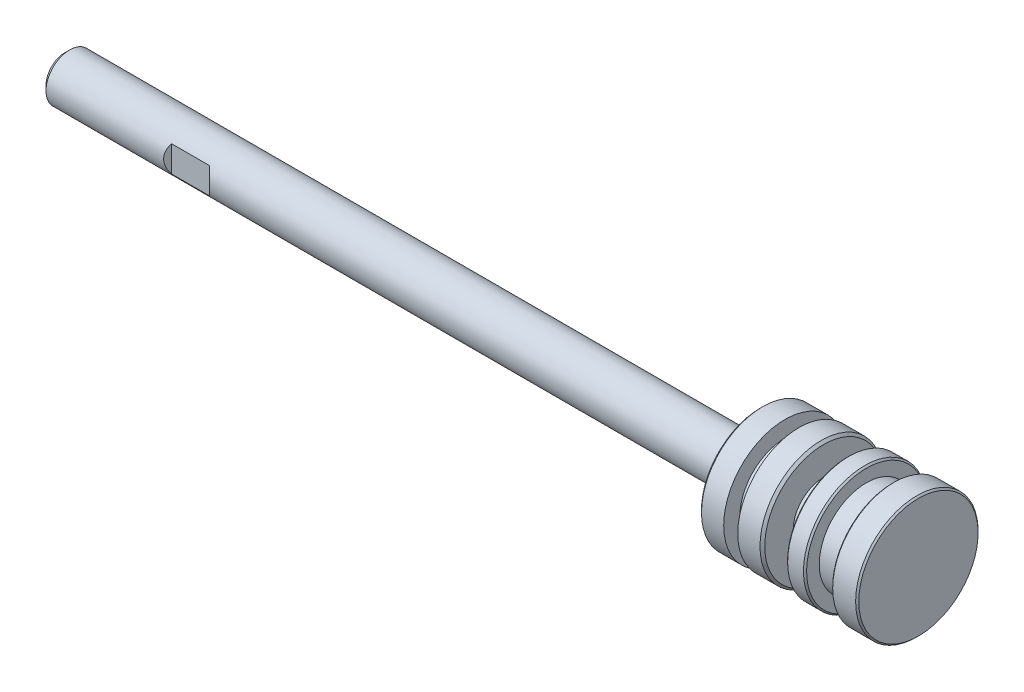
ISO-10303-21;
HEADER;
FILE_DESCRIPTION(('STEP AP214'),'2;1');
FILE_NAME('part.step','',(''),(''),'','','');
FILE_SCHEMA(('AUTOMOTIVE_DESIGN { 1 0 10303 214 1 1 1 1 }'));
ENDSEC;
DATA;
#1=APPLICATION_CONTEXT('core data for automotive mechanical design processes');
#2=APPLICATION_PROTOCOL_DEFINITION('international standard','automotive_design',2000,#1);
#3=PRODUCT_CONTEXT('',#1,'mechanical');
#4=PRODUCT('Part','Part','',(#3));
#5=PRODUCT_RELATED_PRODUCT_CATEGORY('part','',(#4));
#6=PRODUCT_DEFINITION_FORMATION('','',#4);
#7=PRODUCT_DEFINITION_CONTEXT('part definition',#1,'design');
#8=PRODUCT_DEFINITION('design','',#6,#7);
#9=PRODUCT_DEFINITION_SHAPE('','',#8);
#10=(LENGTH_UNIT() NAMED_UNIT(*) SI_UNIT(.MILLI.,.METRE.));
#11=(NAMED_UNIT(*) PLANE_ANGLE_UNIT() SI_UNIT($,.RADIAN.));
#12=(NAMED_UNIT(*) SI_UNIT($,.STERADIAN.) SOLID_ANGLE_UNIT());
#13=UNCERTAINTY_MEASURE_WITH_UNIT(LENGTH_MEASURE(1.E-05),#10,'distance_accuracy_value','');
#14=(GEOMETRIC_REPRESENTATION_CONTEXT(3) GLOBAL_UNCERTAINTY_ASSIGNED_CONTEXT((#13)) GLOBAL_UNIT_ASSIGNED_CONTEXT((#10,
#11,#12)) REPRESENTATION_CONTEXT('',''));
#15=CARTESIAN_POINT('',(0.,0.,0.));
#16=DIRECTION('',(0.,0.,1.));
#17=DIRECTION('',(1.,0.,0.));
#18=AXIS2_PLACEMENT_3D('',#15,#16,#17);
#19=CARTESIAN_POINT('',(108.,7.55,0.));
#20=DIRECTION('',(-1.,0.,0.));
#21=DIRECTION('',(0.,0.,1.));
#22=AXIS2_PLACEMENT_3D('',#19,#20,#21);
#23=PLANE('',#22);
#24=CARTESIAN_POINT('',(108.,0.,0.));
#25=DIRECTION('',(-1.,0.,0.));
#26=DIRECTION('',(0.,0.,1.));
#27=AXIS2_PLACEMENT_3D('',#24,#25,#26);
#28=CIRCLE('',#27,7.55);
#29=CARTESIAN_POINT('',(108.,0.,7.55));
#30=VERTEX_POINT('',#29);
#31=EDGE_CURVE('E20',#30,#30,#28,.T.);
#32=ORIENTED_EDGE('',*,*,#31,.F.);
#33=EDGE_LOOP('',(#32));
#34=FACE_BOUND('',#33,.T.);
#35=ADVANCED_FACE('F17',(#34),#23,.F.);
#36=CARTESIAN_POINT('',(107.8,0.,0.));
#37=DIRECTION('',(-1.,0.,0.));
#38=DIRECTION('',(0.,0.,1.));
#39=AXIS2_PLACEMENT_3D('',#36,#37,#38);
#40=CONICAL_SURFACE('',#39,7.75,0.785398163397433);
#41=ORIENTED_EDGE('',*,*,#31,.T.);
#42=EDGE_LOOP('',(#41));
#43=FACE_BOUND('',#42,.T.);
#44=CARTESIAN_POINT('',(107.8,0.,0.));
#45=DIRECTION('',(-1.,0.,0.));
#46=DIRECTION('',(0.,0.,1.));
#47=AXIS2_PLACEMENT_3D('',#44,#45,#46);
#48=CIRCLE('',#47,7.75);
#49=CARTESIAN_POINT('',(107.8,0.,7.75));
#50=VERTEX_POINT('',#49);
#51=EDGE_CURVE('E107',#50,#50,#48,.T.);
#52=ORIENTED_EDGE('',*,*,#51,.F.);
#53=EDGE_LOOP('',(#52));
#54=FACE_BOUND('',#53,.T.);
#55=ADVANCED_FACE('F469',(#43,#54),#40,.T.);
#56=CARTESIAN_POINT('',(108.,0.,0.));
#57=DIRECTION('',(-1.,0.,0.));
#58=DIRECTION('',(0.,0.,1.));
#59=AXIS2_PLACEMENT_3D('',#56,#57,#58);
#60=CYLINDRICAL_SURFACE('',#59,7.75);
#61=ORIENTED_EDGE('',*,*,#51,.T.);
#62=EDGE_LOOP('',(#61));
#63=FACE_BOUND('',#62,.T.);
#64=CARTESIAN_POINT('',(104.9,0.,0.));
#65=DIRECTION('',(1.,0.,0.));
#66=DIRECTION('',(0.,0.,-1.));
#67=AXIS2_PLACEMENT_3D('',#64,#65,#66);
#68=CIRCLE('',#67,7.75);
#69=CARTESIAN_POINT('',(104.9,0.,-7.75));
#70=VERTEX_POINT('',#69);
#71=EDGE_CURVE('E103',#70,#70,#68,.F.);
#72=ORIENTED_EDGE('',*,*,#71,.F.);
#73=EDGE_LOOP('',(#72));
#74=FACE_BOUND('',#73,.T.);
#75=ADVANCED_FACE('F461',(#63,#74),#60,.T.);
#76=CARTESIAN_POINT('',(104.9,0.,0.));
#77=DIRECTION('',(1.,0.,0.));
#78=DIRECTION('',(0.,1.,0.));
#79=AXIS2_PLACEMENT_3D('',#76,#77,#78);
#80=CONICAL_SURFACE('',#79,7.75,0.785398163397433);
#81=CARTESIAN_POINT('',(104.7,0.,0.));
#82=DIRECTION('',(1.,0.,0.));
#83=DIRECTION('',(0.,1.,0.));
#84=AXIS2_PLACEMENT_3D('',#81,#82,#83);
#85=CIRCLE('',#84,7.55);
#86=CARTESIAN_POINT('',(104.7,7.55,0.));
#87=VERTEX_POINT('',#86);
#88=EDGE_CURVE('E106',#87,#87,#85,.T.);
#89=ORIENTED_EDGE('',*,*,#88,.T.);
#90=EDGE_LOOP('',(#89));
#91=FACE_BOUND('',#90,.T.);
#92=ORIENTED_EDGE('',*,*,#71,.T.);
#93=EDGE_LOOP('',(#92));
#94=FACE_BOUND('',#93,.T.);
#95=ADVANCED_FACE('F152',(#91,#94),#80,.T.);
#96=CARTESIAN_POINT('',(104.7,5.95,0.));
#97=DIRECTION('',(1.,0.,0.));
#98=DIRECTION('',(0.,0.,-1.));
#99=AXIS2_PLACEMENT_3D('',#96,#97,#98);
#100=PLANE('',#99);
#101=ORIENTED_EDGE('',*,*,#88,.F.);
#102=EDGE_LOOP('',(#101));
#103=FACE_BOUND('',#102,.T.);
#104=CARTESIAN_POINT('',(104.7,0.,0.));
#105=DIRECTION('',(-1.,0.,0.));
#106=DIRECTION('',(0.,0.,1.));
#107=AXIS2_PLACEMENT_3D('',#104,#105,#106);
#108=CIRCLE('',#107,5.95);
#109=CARTESIAN_POINT('',(104.7,0.,5.95));
#110=VERTEX_POINT('',#109);
#111=EDGE_CURVE('E147',#110,#110,#108,.T.);
#112=ORIENTED_EDGE('',*,*,#111,.F.);
#113=EDGE_LOOP('',(#112));
#114=FACE_BOUND('',#113,.T.);
#115=ADVANCED_FACE('F155',(#103,#114),#100,.F.);
#116=CARTESIAN_POINT('',(108.,0.,0.));
#117=DIRECTION('',(-1.,0.,0.));
#118=DIRECTION('',(0.,0.,1.));
#119=AXIS2_PLACEMENT_3D('',#116,#117,#118);
#120=CYLINDRICAL_SURFACE('',#119,5.95);
#121=CARTESIAN_POINT('',(101.4,0.,0.));
#122=DIRECTION('',(-1.,0.,0.));
#123=DIRECTION('',(0.,0.,1.));
#124=AXIS2_PLACEMENT_3D('',#121,#122,#123);
#125=CIRCLE('',#124,5.95);
#126=CARTESIAN_POINT('',(101.4,0.,5.95));
#127=VERTEX_POINT('',#126);
#128=EDGE_CURVE('E144',#127,#127,#125,.F.);
#129=ORIENTED_EDGE('',*,*,#128,.T.);
#130=EDGE_LOOP('',(#129));
#131=FACE_BOUND('',#130,.T.);
#132=ORIENTED_EDGE('',*,*,#111,.T.);
#133=EDGE_LOOP('',(#132));
#134=FACE_BOUND('',#133,.T.);
#135=ADVANCED_FACE('F158',(#131,#134),#120,.T.);
#136=CARTESIAN_POINT('',(101.4,7.55,0.));
#137=DIRECTION('',(-1.,0.,0.));
#138=DIRECTION('',(0.,0.,1.));
#139=AXIS2_PLACEMENT_3D('',#136,#137,#138);
#140=PLANE('',#139);
#141=ORIENTED_EDGE('',*,*,#128,.F.);
#142=EDGE_LOOP('',(#141));
#143=FACE_BOUND('',#142,.T.);
#144=CARTESIAN_POINT('',(101.4,0.,0.));
#145=DIRECTION('',(-1.,0.,0.));
#146=DIRECTION('',(0.,-1.,0.));
#147=AXIS2_PLACEMENT_3D('',#144,#145,#146);
#148=CIRCLE('',#147,7.55);
#149=CARTESIAN_POINT('',(101.4,-7.55,0.));
#150=VERTEX_POINT('',#149);
#151=EDGE_CURVE('E102',#150,#150,#148,.T.);
#152=ORIENTED_EDGE('',*,*,#151,.F.);
#153=EDGE_LOOP('',(#152));
#154=FACE_BOUND('',#153,.T.);
#155=ADVANCED_FACE('F163',(#143,#154),#140,.F.);
#156=CARTESIAN_POINT('',(101.2,0.,0.));
#157=DIRECTION('',(-1.,0.,0.));
#158=DIRECTION('',(0.,-1.,0.));
#159=AXIS2_PLACEMENT_3D('',#156,#157,#158);
#160=CONICAL_SURFACE('',#159,7.75,0.785398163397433);
#161=ORIENTED_EDGE('',*,*,#151,.T.);
#162=EDGE_LOOP('',(#161));
#163=FACE_BOUND('',#162,.T.);
#164=CARTESIAN_POINT('',(101.2,0.,0.));
#165=DIRECTION('',(-1.,0.,0.));
#166=DIRECTION('',(0.,0.,1.));
#167=AXIS2_PLACEMENT_3D('',#164,#165,#166);
#168=CIRCLE('',#167,7.75);
#169=CARTESIAN_POINT('',(101.2,0.,7.75));
#170=VERTEX_POINT('',#169);
#171=EDGE_CURVE('E99',#170,#170,#168,.T.);
#172=ORIENTED_EDGE('',*,*,#171,.F.);
#173=EDGE_LOOP('',(#172));
#174=FACE_BOUND('',#173,.T.);
#175=ADVANCED_FACE('F170',(#163,#174),#160,.T.);
#176=CARTESIAN_POINT('',(108.,0.,0.));
#177=DIRECTION('',(-1.,0.,0.));
#178=DIRECTION('',(0.,0.,1.));
#179=AXIS2_PLACEMENT_3D('',#176,#177,#178);
#180=CYLINDRICAL_SURFACE('',#179,7.75);
#181=ORIENTED_EDGE('',*,*,#171,.T.);
#182=EDGE_LOOP('',(#181));
#183=FACE_BOUND('',#182,.T.);
#184=CARTESIAN_POINT('',(99.2,0.,0.));
#185=DIRECTION('',(1.,0.,0.));
#186=DIRECTION('',(0.,0.,-1.));
#187=AXIS2_PLACEMENT_3D('',#184,#185,#186);
#188=CIRCLE('',#187,7.75);
#189=CARTESIAN_POINT('',(99.2,0.,-7.75));
#190=VERTEX_POINT('',#189);
#191=EDGE_CURVE('E95',#190,#190,#188,.F.);
#192=ORIENTED_EDGE('',*,*,#191,.F.);
#193=EDGE_LOOP('',(#192));
#194=FACE_BOUND('',#193,.T.);
#195=ADVANCED_FACE('F254',(#183,#194),#180,.T.);
#196=CARTESIAN_POINT('',(99.2,0.,0.));
#197=DIRECTION('',(1.,0.,0.));
#198=DIRECTION('',(0.,0.,-1.));
#199=AXIS2_PLACEMENT_3D('',#196,#197,#198);
#200=CONICAL_SURFACE('',#199,7.75,0.785398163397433);
#201=CARTESIAN_POINT('',(99.,0.,0.));
#202=DIRECTION('',(1.,0.,0.));
#203=DIRECTION('',(0.,0.,-1.));
#204=AXIS2_PLACEMENT_3D('',#201,#202,#203);
#205=CIRCLE('',#204,7.54999999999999);
#206=CARTESIAN_POINT('',(99.,0.,-7.54999999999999));
#207=VERTEX_POINT('',#206);
#208=EDGE_CURVE('E98',#207,#207,#205,.T.);
#209=ORIENTED_EDGE('',*,*,#208,.T.);
#210=EDGE_LOOP('',(#209));
#211=FACE_BOUND('',#210,.T.);
#212=ORIENTED_EDGE('',*,*,#191,.T.);
#213=EDGE_LOOP('',(#212));
#214=FACE_BOUND('',#213,.T.);
#215=ADVANCED_FACE('F250',(#211,#214),#200,.T.);
#216=CARTESIAN_POINT('',(99.,3.85,0.));
#217=DIRECTION('',(1.,0.,0.));
#218=DIRECTION('',(0.,0.,-1.));
#219=AXIS2_PLACEMENT_3D('',#216,#217,#218);
#220=PLANE('',#219);
#221=ORIENTED_EDGE('',*,*,#208,.F.);
#222=EDGE_LOOP('',(#221));
#223=FACE_BOUND('',#222,.T.);
#224=CARTESIAN_POINT('',(99.,0.,0.));
#225=DIRECTION('',(-1.,0.,0.));
#226=DIRECTION('',(0.,0.,1.));
#227=AXIS2_PLACEMENT_3D('',#224,#225,#226);
#228=CIRCLE('',#227,3.85);
#229=CARTESIAN_POINT('',(99.,0.,3.85));
#230=VERTEX_POINT('',#229);
#231=EDGE_CURVE('E137',#230,#230,#228,.T.);
#232=ORIENTED_EDGE('',*,*,#231,.F.);
#233=EDGE_LOOP('',(#232));
#234=FACE_BOUND('',#233,.T.);
#235=ADVANCED_FACE('F246',(#223,#234),#220,.F.);
#236=CARTESIAN_POINT('',(108.,0.,0.));
#237=DIRECTION('',(-1.,0.,0.));
#238=DIRECTION('',(0.,0.,1.));
#239=AXIS2_PLACEMENT_3D('',#236,#237,#238);
#240=CYLINDRICAL_SURFACE('',#239,3.85);
#241=CARTESIAN_POINT('',(96.,0.,0.));
#242=DIRECTION('',(-1.,0.,0.));
#243=DIRECTION('',(0.,0.,1.));
#244=AXIS2_PLACEMENT_3D('',#241,#242,#243);
#245=CIRCLE('',#244,3.85);
#246=CARTESIAN_POINT('',(96.,0.,3.85));
#247=VERTEX_POINT('',#246);
#248=EDGE_CURVE('E134',#247,#247,#245,.F.);
#249=ORIENTED_EDGE('',*,*,#248,.T.);
#250=EDGE_LOOP('',(#249));
#251=FACE_BOUND('',#250,.T.);
#252=ORIENTED_EDGE('',*,*,#231,.T.);
#253=EDGE_LOOP('',(#252));
#254=FACE_BOUND('',#253,.T.);
#255=ADVANCED_FACE('F242',(#251,#254),#240,.T.);
#256=CARTESIAN_POINT('',(96.,7.45,0.));
#257=DIRECTION('',(-1.,0.,0.));
#258=DIRECTION('',(0.,0.,1.));
#259=AXIS2_PLACEMENT_3D('',#256,#257,#258);
#260=PLANE('',#259);
#261=ORIENTED_EDGE('',*,*,#248,.F.);
#262=EDGE_LOOP('',(#261));
#263=FACE_BOUND('',#262,.T.);
#264=CARTESIAN_POINT('',(96.,0.,0.));
#265=DIRECTION('',(-1.,0.,0.));
#266=DIRECTION('',(0.,-1.,0.));
#267=AXIS2_PLACEMENT_3D('',#264,#265,#266);
#268=CIRCLE('',#267,7.45);
#269=CARTESIAN_POINT('',(96.,-7.45,0.));
#270=VERTEX_POINT('',#269);
#271=EDGE_CURVE('E94',#270,#270,#268,.T.);
#272=ORIENTED_EDGE('',*,*,#271,.F.);
#273=EDGE_LOOP('',(#272));
#274=FACE_BOUND('',#273,.T.);
#275=ADVANCED_FACE('F238',(#263,#274),#260,.F.);
#276=CARTESIAN_POINT('',(95.7,0.,0.));
#277=DIRECTION('',(-1.,0.,0.));
#278=DIRECTION('',(0.,-1.,0.));
#279=AXIS2_PLACEMENT_3D('',#276,#277,#278);
#280=CONICAL_SURFACE('',#279,7.75,0.785398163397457);
#281=CARTESIAN_POINT('',(95.7,0.,0.));
#282=DIRECTION('',(-1.,0.,0.));
#283=DIRECTION('',(0.,0.,1.));
#284=AXIS2_PLACEMENT_3D('',#281,#282,#283);
#285=CIRCLE('',#284,7.75);
#286=CARTESIAN_POINT('',(95.7,0.,7.75));
#287=VERTEX_POINT('',#286);
#288=EDGE_CURVE('E90',#287,#287,#285,.T.);
#289=ORIENTED_EDGE('',*,*,#288,.F.);
#290=EDGE_LOOP('',(#289));
#291=FACE_BOUND('',#290,.T.);
#292=ORIENTED_EDGE('',*,*,#271,.T.);
#293=EDGE_LOOP('',(#292));
#294=FACE_BOUND('',#293,.T.);
#295=ADVANCED_FACE('F234',(#291,#294),#280,.T.);
#296=CARTESIAN_POINT('',(108.,0.,0.));
#297=DIRECTION('',(-1.,0.,0.));
#298=DIRECTION('',(0.,0.,1.));
#299=AXIS2_PLACEMENT_3D('',#296,#297,#298);
#300=CYLINDRICAL_SURFACE('',#299,7.75);
#301=CARTESIAN_POINT('',(92.89,0.,0.));
#302=DIRECTION('',(-1.,0.,0.));
#303=DIRECTION('',(0.,0.,1.));
#304=AXIS2_PLACEMENT_3D('',#301,#302,#303);
#305=CIRCLE('',#304,7.75);
#306=CARTESIAN_POINT('',(92.89,0.,7.75));
#307=VERTEX_POINT('',#306);
#308=EDGE_CURVE('E93',#307,#307,#305,.F.);
#309=ORIENTED_EDGE('',*,*,#308,.T.);
#310=EDGE_LOOP('',(#309));
#311=FACE_BOUND('',#310,.T.);
#312=ORIENTED_EDGE('',*,*,#288,.T.);
#313=EDGE_LOOP('',(#312));
#314=FACE_BOUND('',#313,.T.);
#315=ADVANCED_FACE('F230',(#311,#314),#300,.T.);
#316=CARTESIAN_POINT('',(92.89,5.7,0.));
#317=DIRECTION('',(1.,0.,0.));
#318=DIRECTION('',(0.,0.,-1.));
#319=AXIS2_PLACEMENT_3D('',#316,#317,#318);
#320=PLANE('',#319);
#321=ORIENTED_EDGE('',*,*,#308,.F.);
#322=EDGE_LOOP('',(#321));
#323=FACE_BOUND('',#322,.T.);
#324=CARTESIAN_POINT('',(92.89,0.,0.));
#325=DIRECTION('',(-1.,0.,0.));
#326=DIRECTION('',(0.,0.,1.));
#327=AXIS2_PLACEMENT_3D('',#324,#325,#326);
#328=CIRCLE('',#327,5.7);
#329=CARTESIAN_POINT('',(92.89,0.,5.7));
#330=VERTEX_POINT('',#329);
#331=EDGE_CURVE('E127',#330,#330,#328,.T.);
#332=ORIENTED_EDGE('',*,*,#331,.F.);
#333=EDGE_LOOP('',(#332));
#334=FACE_BOUND('',#333,.T.);
#335=ADVANCED_FACE('F226',(#323,#334),#320,.F.);
#336=CARTESIAN_POINT('',(108.,0.,0.));
#337=DIRECTION('',(-1.,0.,0.));
#338=DIRECTION('',(0.,0.,1.));
#339=AXIS2_PLACEMENT_3D('',#336,#337,#338);
#340=CYLINDRICAL_SURFACE('',#339,5.7);
#341=CARTESIAN_POINT('',(91.11,0.,0.));
#342=DIRECTION('',(-1.,0.,0.));
#343=DIRECTION('',(0.,0.,1.));
#344=AXIS2_PLACEMENT_3D('',#341,#342,#343);
#345=CIRCLE('',#344,5.7);
#346=CARTESIAN_POINT('',(91.11,0.,5.7));
#347=VERTEX_POINT('',#346);
#348=EDGE_CURVE('E124',#347,#347,#345,.F.);
#349=ORIENTED_EDGE('',*,*,#348,.T.);
#350=EDGE_LOOP('',(#349));
#351=FACE_BOUND('',#350,.T.);
#352=ORIENTED_EDGE('',*,*,#331,.T.);
#353=EDGE_LOOP('',(#352));
#354=FACE_BOUND('',#353,.T.);
#355=ADVANCED_FACE('F222',(#351,#354),#340,.T.);
#356=CARTESIAN_POINT('',(91.11,7.75,0.));
#357=DIRECTION('',(-1.,0.,0.));
#358=DIRECTION('',(0.,0.,1.));
#359=AXIS2_PLACEMENT_3D('',#356,#357,#358);
#360=PLANE('',#359);
#361=ORIENTED_EDGE('',*,*,#348,.F.);
#362=EDGE_LOOP('',(#361));
#363=FACE_BOUND('',#362,.T.);
#364=CARTESIAN_POINT('',(91.11,0.,0.));
#365=DIRECTION('',(-1.,0.,0.));
#366=DIRECTION('',(0.,0.,1.));
#367=AXIS2_PLACEMENT_3D('',#364,#365,#366);
#368=CIRCLE('',#367,7.75);
#369=CARTESIAN_POINT('',(91.11,0.,7.75));
#370=VERTEX_POINT('',#369);
#371=EDGE_CURVE('E89',#370,#370,#368,.T.);
#372=ORIENTED_EDGE('',*,*,#371,.F.);
#373=EDGE_LOOP('',(#372));
#374=FACE_BOUND('',#373,.T.);
#375=ADVANCED_FACE('F218',(#363,#374),#360,.F.);
#376=CARTESIAN_POINT('',(108.,0.,0.));
#377=DIRECTION('',(-1.,0.,0.));
#378=DIRECTION('',(0.,0.,1.));
#379=AXIS2_PLACEMENT_3D('',#376,#377,#378);
#380=CYLINDRICAL_SURFACE('',#379,7.75);
#381=ORIENTED_EDGE('',*,*,#371,.T.);
#382=EDGE_LOOP('',(#381));
#383=FACE_BOUND('',#382,.T.);
#384=CARTESIAN_POINT('',(88.3,0.,0.));
#385=DIRECTION('',(1.,0.,0.));
#386=DIRECTION('',(0.,0.,-1.));
#387=AXIS2_PLACEMENT_3D('',#384,#385,#386);
#388=CIRCLE('',#387,7.75);
#389=CARTESIAN_POINT('',(88.3,0.,-7.75));
#390=VERTEX_POINT('',#389);
#391=EDGE_CURVE('E86',#390,#390,#388,.F.);
#392=ORIENTED_EDGE('',*,*,#391,.F.);
#393=EDGE_LOOP('',(#392));
#394=FACE_BOUND('',#393,.T.);
#395=ADVANCED_FACE('F214',(#383,#394),#380,.T.);
#396=CARTESIAN_POINT('',(88.3,0.,0.));
#397=DIRECTION('',(1.,0.,0.));
#398=DIRECTION('',(0.,1.,0.));
#399=AXIS2_PLACEMENT_3D('',#396,#397,#398);
#400=CONICAL_SURFACE('',#399,7.75,0.785398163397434);
#401=CARTESIAN_POINT('',(88.,0.,0.));
#402=DIRECTION('',(1.,0.,0.));
#403=DIRECTION('',(0.,1.,0.));
#404=AXIS2_PLACEMENT_3D('',#401,#402,#403);
#405=CIRCLE('',#404,7.45);
#406=CARTESIAN_POINT('',(88.,7.45,0.));
#407=VERTEX_POINT('',#406);
#408=EDGE_CURVE('E85',#407,#407,#405,.T.);
#409=ORIENTED_EDGE('',*,*,#408,.T.);
#410=EDGE_LOOP('',(#409));
#411=FACE_BOUND('',#410,.T.);
#412=ORIENTED_EDGE('',*,*,#391,.T.);
#413=EDGE_LOOP('',(#412));
#414=FACE_BOUND('',#413,.T.);
#415=ADVANCED_FACE('F210',(#411,#414),#400,.T.);
#416=CARTESIAN_POINT('',(0.,0.,0.));
#417=DIRECTION('',(1.,0.,0.));
#418=DIRECTION('',(0.,0.,-1.));
#419=AXIS2_PLACEMENT_3D('',#416,#417,#418);
#420=PLANE('',#419);
#421=CARTESIAN_POINT('',(-5.6843418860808E-11,0.,0.));
#422=DIRECTION('',(1.,0.,0.));
#423=DIRECTION('',(0.,0.,-1.));
#424=AXIS2_PLACEMENT_3D('',#421,#422,#423);
#425=CIRCLE('',#424,2.38650000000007);
#426=CARTESIAN_POINT('',(-5.6843418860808E-11,0.,-2.38650000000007));
#427=VERTEX_POINT('',#426);
#428=EDGE_CURVE('E76',#427,#427,#425,.T.);
#429=ORIENTED_EDGE('',*,*,#428,.F.);
#430=EDGE_LOOP('',(#429));
#431=FACE_BOUND('',#430,.T.);
#432=ADVANCED_FACE('F206',(#431),#420,.F.);
#433=CARTESIAN_POINT('',(88.,3.,0.));
#434=DIRECTION('',(1.,0.,0.));
#435=DIRECTION('',(0.,0.,-1.));
#436=AXIS2_PLACEMENT_3D('',#433,#434,#435);
#437=PLANE('',#436);
#438=ORIENTED_EDGE('',*,*,#408,.F.);
#439=EDGE_LOOP('',(#438));
#440=FACE_BOUND('',#439,.T.);
#441=CARTESIAN_POINT('',(88.,0.,0.));
#442=DIRECTION('',(-1.,0.,0.));
#443=DIRECTION('',(0.,0.,1.));
#444=AXIS2_PLACEMENT_3D('',#441,#442,#443);
#445=CIRCLE('',#444,3.);
#446=CARTESIAN_POINT('',(88.,0.,3.));
#447=VERTEX_POINT('',#446);
#448=EDGE_CURVE('E71',#447,#447,#445,.T.);
#449=ORIENTED_EDGE('',*,*,#448,.F.);
#450=EDGE_LOOP('',(#449));
#451=FACE_BOUND('',#450,.T.);
#452=ADVANCED_FACE('F202',(#440,#451),#437,.F.);
#453=CARTESIAN_POINT('',(20.8,-2.5,-2.5));
#454=DIRECTION('',(0.707106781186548,0.,0.707106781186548));
#455=DIRECTION('',(0.707106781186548,0.,-0.707106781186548));
#456=AXIS2_PLACEMENT_3D('',#453,#454,#455);
#457=PLANE('',#456);
#458=CARTESIAN_POINT('',(18.3,0.,0.));
#459=DIRECTION('',(0.707106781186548,0.,0.707106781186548));
#460=DIRECTION('',(-0.707106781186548,0.,0.707106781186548));
#461=AXIS2_PLACEMENT_3D('',#458,#459,#460);
#462=ELLIPSE('',#461,4.24264068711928,3.);
#463=CARTESIAN_POINT('',(20.8,-1.6583123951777,-2.5));
#464=VERTEX_POINT('',#463);
#465=CARTESIAN_POINT('',(20.8,1.6583123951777,-2.5));
#466=VERTEX_POINT('',#465);
#467=EDGE_CURVE('E113',#464,#466,#462,.T.);
#468=ORIENTED_EDGE('',*,*,#467,.F.);
#469=DIRECTION('',(0.,1.,0.));
#470=VECTOR('',#469,1.);
#471=CARTESIAN_POINT('',(20.8,-2.5,-2.5));
#472=LINE('',#471,#470);
#473=EDGE_CURVE('E83',#464,#466,#472,.T.);
#474=ORIENTED_EDGE('',*,*,#473,.T.);
#475=EDGE_LOOP('',(#468,#474));
#476=FACE_BOUND('',#475,.T.);
#477=ADVANCED_FACE('F198',(#476),#457,.F.);
#478=CARTESIAN_POINT('',(16.,-2.5,-2.5));
#479=DIRECTION('',(0.,0.,1.));
#480=DIRECTION('',(1.,0.,0.));
#481=AXIS2_PLACEMENT_3D('',#478,#479,#480);
#482=PLANE('',#481);
#483=DIRECTION('',(-1.,0.,0.));
#484=VECTOR('',#483,1.);
#485=CARTESIAN_POINT('',(108.,-1.6583123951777,-2.5));
#486=LINE('',#485,#484);
#487=CARTESIAN_POINT('',(16.,-1.6583123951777,-2.5));
#488=VERTEX_POINT('',#487);
#489=EDGE_CURVE('E68',#488,#464,#486,.F.);
#490=ORIENTED_EDGE('',*,*,#489,.F.);
#491=DIRECTION('',(0.,1.,0.));
#492=VECTOR('',#491,1.);
#493=CARTESIAN_POINT('',(16.,-2.5,-2.5));
#494=LINE('',#493,#492);
#495=CARTESIAN_POINT('',(16.,1.6583123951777,-2.5));
#496=VERTEX_POINT('',#495);
#497=EDGE_CURVE('E81',#488,#496,#494,.T.);
#498=ORIENTED_EDGE('',*,*,#497,.T.);
#499=DIRECTION('',(-1.,0.,0.));
#500=VECTOR('',#499,1.);
#501=CARTESIAN_POINT('',(108.,1.6583123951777,-2.5));
#502=LINE('',#501,#500);
#503=EDGE_CURVE('E112',#466,#496,#502,.T.);
#504=ORIENTED_EDGE('',*,*,#503,.F.);
#505=ORIENTED_EDGE('',*,*,#473,.F.);
#506=EDGE_LOOP('',(#490,#498,#504,#505));
#507=FACE_BOUND('',#506,.T.);
#508=ADVANCED_FACE('F194',(#507),#482,.F.);
#509=CARTESIAN_POINT('',(14.4,-2.5,-4.1));
#510=DIRECTION('',(-0.707106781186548,0.,0.707106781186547));
#511=DIRECTION('',(0.707106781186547,0.,0.707106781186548));
#512=AXIS2_PLACEMENT_3D('',#509,#510,#511);
#513=PLANE('',#512);
#514=ORIENTED_EDGE('',*,*,#497,.F.);
#515=CARTESIAN_POINT('',(18.5,0.,0.));
#516=DIRECTION('',(-0.707106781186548,0.,0.707106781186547));
#517=DIRECTION('',(-0.707106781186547,0.,-0.707106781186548));
#518=AXIS2_PLACEMENT_3D('',#515,#516,#517);
#519=ELLIPSE('',#518,4.24264068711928,3.);
#520=EDGE_CURVE('E80',#496,#488,#519,.T.);
#521=ORIENTED_EDGE('',*,*,#520,.F.);
#522=EDGE_LOOP('',(#514,#521));
#523=FACE_BOUND('',#522,.T.);
#524=ADVANCED_FACE('F190',(#523),#513,.F.);
#525=CARTESIAN_POINT('',(0.613500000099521,0.,0.));
#526=DIRECTION('',(1.,0.,0.));
#527=DIRECTION('',(0.,0.,-1.));
#528=AXIS2_PLACEMENT_3D('',#525,#526,#527);
#529=CONICAL_SURFACE('',#528,3.00000000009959,0.785398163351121);
#530=CARTESIAN_POINT('',(0.613500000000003,0.,0.));
#531=DIRECTION('',(-1.,0.,0.));
#532=DIRECTION('',(0.,0.,1.));
#533=AXIS2_PLACEMENT_3D('',#530,#531,#532);
#534=CIRCLE('',#533,3.);
#535=CARTESIAN_POINT('',(0.613500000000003,0.,3.));
#536=VERTEX_POINT('',#535);
#537=EDGE_CURVE('E77',#536,#536,#534,.F.);
#538=ORIENTED_EDGE('',*,*,#537,.F.);
#539=EDGE_LOOP('',(#538));
#540=FACE_BOUND('',#539,.T.);
#541=ORIENTED_EDGE('',*,*,#428,.T.);
#542=EDGE_LOOP('',(#541));
#543=FACE_BOUND('',#542,.T.);
#544=ADVANCED_FACE('F187',(#540,#543),#529,.T.);
#545=CARTESIAN_POINT('',(16.,-2.5,2.5));
#546=DIRECTION('',(-0.707106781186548,0.,-0.707106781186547));
#547=DIRECTION('',(-0.707106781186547,0.,0.707106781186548));
#548=AXIS2_PLACEMENT_3D('',#545,#546,#547);
#549=PLANE('',#548);
#550=CARTESIAN_POINT('',(18.5,0.,0.));
#551=DIRECTION('',(-0.707106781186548,0.,-0.707106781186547));
#552=DIRECTION('',(-0.707106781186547,0.,0.707106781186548));
#553=AXIS2_PLACEMENT_3D('',#550,#551,#552);
#554=ELLIPSE('',#553,4.24264068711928,3.);
#555=CARTESIAN_POINT('',(16.,-1.6583123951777,2.5));
#556=VERTEX_POINT('',#555);
#557=CARTESIAN_POINT('',(16.,1.6583123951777,2.5));
#558=VERTEX_POINT('',#557);
#559=EDGE_CURVE('E55',#556,#558,#554,.T.);
#560=ORIENTED_EDGE('',*,*,#559,.F.);
#561=DIRECTION('',(0.,1.,0.));
#562=VECTOR('',#561,1.);
#563=CARTESIAN_POINT('',(16.,-2.5,2.5));
#564=LINE('',#563,#562);
#565=EDGE_CURVE('E65',#556,#558,#564,.T.);
#566=ORIENTED_EDGE('',*,*,#565,.T.);
#567=EDGE_LOOP('',(#560,#566));
#568=FACE_BOUND('',#567,.T.);
#569=ADVANCED_FACE('F184',(#568),#549,.F.);
#570=CARTESIAN_POINT('',(20.8,-2.5,2.5));
#571=DIRECTION('',(0.,0.,-1.));
#572=DIRECTION('',(-1.,0.,0.));
#573=AXIS2_PLACEMENT_3D('',#570,#571,#572);
#574=PLANE('',#573);
#575=DIRECTION('',(-1.,0.,0.));
#576=VECTOR('',#575,1.);
#577=CARTESIAN_POINT('',(108.,1.6583123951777,2.5));
#578=LINE('',#577,#576);
#579=CARTESIAN_POINT('',(20.8,1.6583123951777,2.5));
#580=VERTEX_POINT('',#579);
#581=EDGE_CURVE('E26',#558,#580,#578,.F.);
#582=ORIENTED_EDGE('',*,*,#581,.F.);
#583=ORIENTED_EDGE('',*,*,#565,.F.);
#584=DIRECTION('',(-1.,0.,0.));
#585=VECTOR('',#584,1.);
#586=CARTESIAN_POINT('',(108.,-1.6583123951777,2.5));
#587=LINE('',#586,#585);
#588=CARTESIAN_POINT('',(20.8,-1.65831239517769,2.5));
#589=VERTEX_POINT('',#588);
#590=EDGE_CURVE('E62',#589,#556,#587,.T.);
#591=ORIENTED_EDGE('',*,*,#590,.F.);
#592=DIRECTION('',(0.,1.,0.));
#593=VECTOR('',#592,1.);
#594=CARTESIAN_POINT('',(20.8,-2.5,2.5));
#595=LINE('',#594,#593);
#596=EDGE_CURVE('E35',#589,#580,#595,.T.);
#597=ORIENTED_EDGE('',*,*,#596,.T.);
#598=EDGE_LOOP('',(#582,#583,#591,#597));
#599=FACE_BOUND('',#598,.T.);
#600=ADVANCED_FACE('F67',(#599),#574,.F.);
#601=CARTESIAN_POINT('',(30.3,-2.5,12.));
#602=DIRECTION('',(0.707106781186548,0.,-0.707106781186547));
#603=DIRECTION('',(-0.707106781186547,0.,-0.707106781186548));
#604=AXIS2_PLACEMENT_3D('',#601,#602,#603);
#605=PLANE('',#604);
#606=ORIENTED_EDGE('',*,*,#596,.F.);
#607=CARTESIAN_POINT('',(18.3,0.,0.));
#608=DIRECTION('',(0.707106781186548,0.,-0.707106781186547));
#609=DIRECTION('',(-0.707106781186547,0.,-0.707106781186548));
#610=AXIS2_PLACEMENT_3D('',#607,#608,#609);
#611=ELLIPSE('',#610,4.24264068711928,3.);
#612=EDGE_CURVE('E11',#580,#589,#611,.T.);
#613=ORIENTED_EDGE('',*,*,#612,.F.);
#614=EDGE_LOOP('',(#606,#613));
#615=FACE_BOUND('',#614,.T.);
#616=ADVANCED_FACE('F64',(#615),#605,.F.);
#617=CARTESIAN_POINT('',(108.,0.,0.));
#618=DIRECTION('',(-1.,0.,0.));
#619=DIRECTION('',(0.,0.,1.));
#620=AXIS2_PLACEMENT_3D('',#617,#618,#619);
#621=CYLINDRICAL_SURFACE('',#620,3.);
#622=ORIENTED_EDGE('',*,*,#489,.T.);
#623=ORIENTED_EDGE('',*,*,#467,.T.);
#624=ORIENTED_EDGE('',*,*,#503,.T.);
#625=ORIENTED_EDGE('',*,*,#520,.T.);
#626=EDGE_LOOP('',(#622,#623,#624,#625));
#627=FACE_BOUND('',#626,.T.);
#628=ORIENTED_EDGE('',*,*,#537,.T.);
#629=EDGE_LOOP('',(#628));
#630=FACE_BOUND('',#629,.T.);
#631=ORIENTED_EDGE('',*,*,#590,.T.);
#632=ORIENTED_EDGE('',*,*,#559,.T.);
#633=ORIENTED_EDGE('',*,*,#581,.T.);
#634=ORIENTED_EDGE('',*,*,#612,.T.);
#635=EDGE_LOOP('',(#631,#632,#633,#634));
#636=FACE_BOUND('',#635,.T.);
#637=ORIENTED_EDGE('',*,*,#448,.T.);
#638=EDGE_LOOP('',(#637));
#639=FACE_BOUND('',#638,.T.);
#640=ADVANCED_FACE('F60',(#627,#630,#636,#639),#621,.T.);
#641=CLOSED_SHELL('',(#35,#55,#75,#95,#115,#135,#155,#175,#195,#215,#235,#255,#275,#295,#315,
#335,#355,#375,#395,#415,#432,#452,#477,#508,#524,#544,#569,#600,#616,#640));
#642=MANIFOLD_SOLID_BREP('B1',#641);
#643=ADVANCED_BREP_SHAPE_REPRESENTATION('',(#18,#642),#14);
#644=SHAPE_DEFINITION_REPRESENTATION(#9,#643);
ENDSEC;
END-ISO-10303-21;
